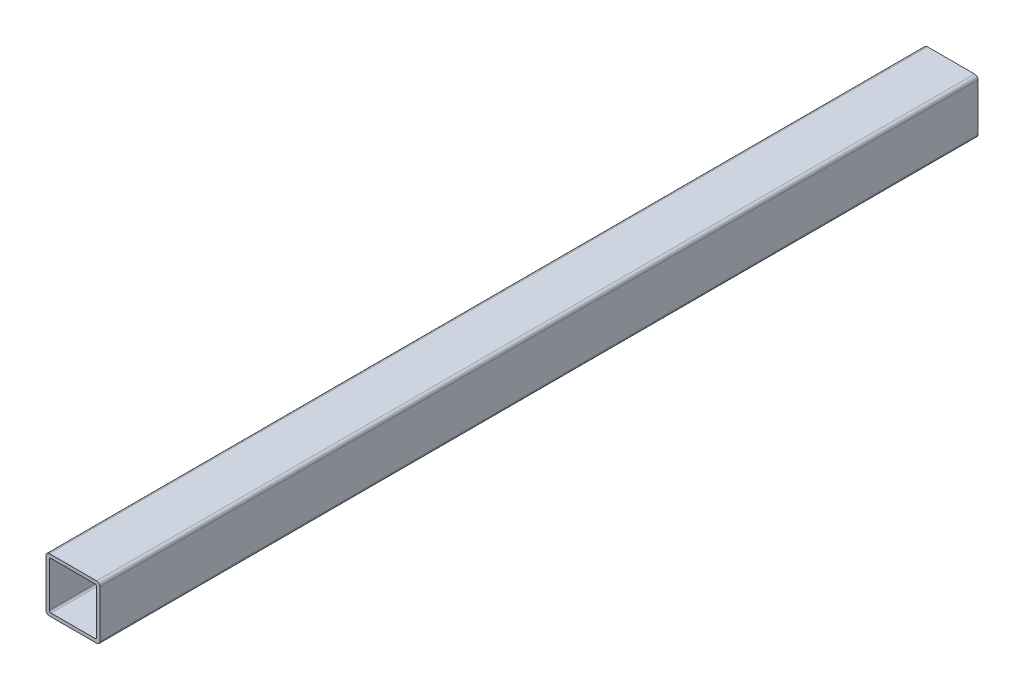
from build123d import *

# Parameters (mm, degrees)
BOSS_EXTRUDE1_DEPTH = 412.75


with BuildPart() as part:
    # Sketch1 → Boss-Extrude1 (new, symmetric)
    with BuildSketch(Plane.XY):
        with BuildLine():
            Line((-22.225, 25.4), (22.225, 25.4))
            ThreePointArc((22.225, 25.4), (24.47006403, 24.47006403), (25.4, 22.225))
            Line((25.4, 22.225), (25.4, -22.225))
            ThreePointArc((25.4, -22.225), (24.47006403, -24.47006403), (22.225, -25.4))
            Line((22.225, -25.4), (-22.225, -25.4))
            ThreePointArc((-22.225, -25.4), (-24.47006403, -24.47006403), (-25.4, -22.225))
            Line((-25.4, -22.225), (-25.4, 22.225))
            ThreePointArc((-25.4, 22.225), (-24.47006403, 24.47006403), (-22.225, 25.4))
        make_face()
        with BuildLine():
            Line((-20.6375, 22.225), (20.6375, 22.225))
            ThreePointArc((20.6375, 22.225), (21.760032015, 21.760032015), (22.225, 20.6375))
            Line((22.225, 20.6375), (22.225, -20.6375))
            ThreePointArc((22.225, -20.6375), (21.760032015, -21.760032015), (20.6375, -22.225))
            Line((20.6375, -22.225), (-20.6375, -22.225))
            ThreePointArc((-20.6375, -22.225), (-21.760032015, -21.760032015), (-22.225, -20.6375))
            Line((-22.225, -20.6375), (-22.225, 20.6375))
            ThreePointArc((-22.225, 20.6375), (-21.760032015, 21.760032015), (-20.6375, 22.225))
        make_face(mode=Mode.SUBTRACT)
    extrude(amount=BOSS_EXTRUDE1_DEPTH, both=True)


solid = part.part
